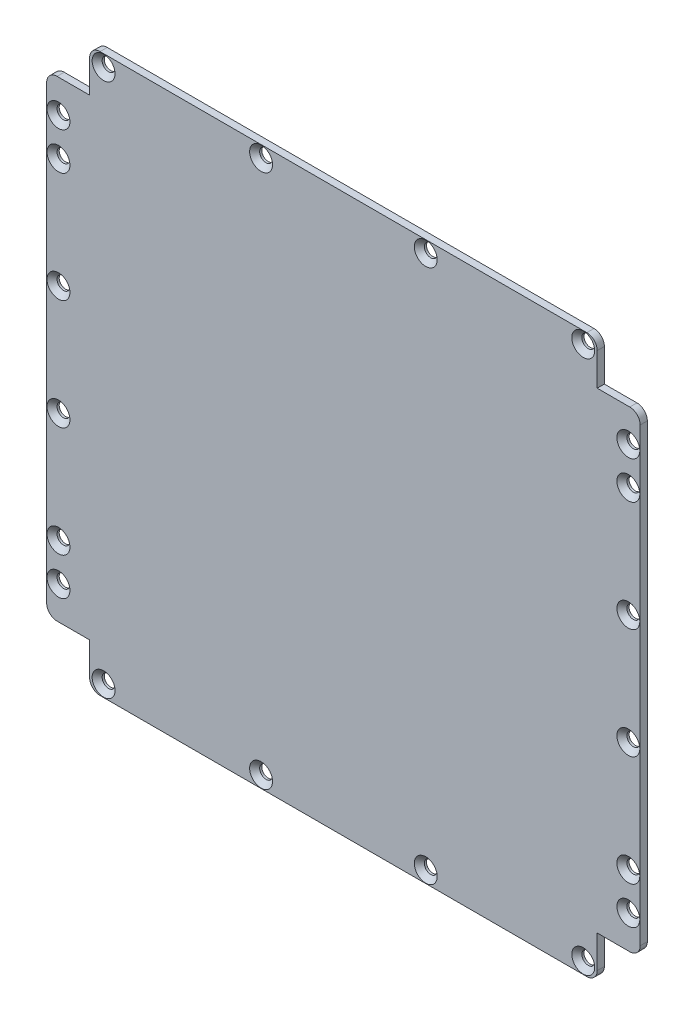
from build123d import *

# Parameters (mm, degrees)
EXTRUDE_1_DEPTH                   = 1
HOLE_WIZARD_1_8_1_8_1_AT_2_COUNT  = 2
HOLE_WIZARD_1_8_1_8_1_AT_2_PITCH  = 22
HOLE_WIZARD_1_8_1_8_1_AT_3_COUNT  = 2
HOLE_WIZARD_1_8_1_8_1_AT_3_PITCH  = 45
HOLE_WIZARD_1_8_1_8_1_AT_4_COUNT  = 2
HOLE_WIZARD_1_8_1_8_1_AT_4_PITCH  = 67
HOLE_WIZARD_1_8_1_8_1_AT_5_COUNT  = 2
HOLE_WIZARD_1_8_1_8_1_AT_5_PITCH  = 73.844380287
HOLE_WIZARD_1_8_1_8_1_AT_6_COUNT  = 2
HOLE_WIZARD_1_8_1_8_1_AT_6_PITCH  = 74.662775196
HOLE_WIZARD_1_8_1_8_1_AT_7_COUNT  = 2
HOLE_WIZARD_1_8_1_8_1_AT_7_PITCH  = 79.050932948
HOLE_WIZARD_1_8_1_8_1_AT_8_COUNT  = 2
HOLE_WIZARD_1_8_1_8_1_AT_8_PITCH  = 86.01098767
HOLE_WIZARD_1_8_1_8_1_AT_9_COUNT  = 2
HOLE_WIZARD_1_8_1_8_1_AT_9_PITCH  = 94.979208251
HOLE_WIZARD_1_8_1_8_1_AT_10_COUNT = 2
HOLE_WIZARD_1_8_1_8_1_AT_10_PITCH = 98.40128302
HOLE_WIZARD_1_8_1_8_1_AT_11_COUNT = 2
HOLE_WIZARD_1_8_1_8_1_AT_11_PITCH = 100.270434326
HOLE_WIZARD_1_8_1_8_1_AT_12_COUNT = 2
HOLE_WIZARD_1_8_1_8_1_AT_12_PITCH = 87.121524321
HOLE_WIZARD_1_8_1_8_1_AT_13_COUNT = 2
HOLE_WIZARD_1_8_1_8_1_AT_13_PITCH = 77.776346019
HOLE_WIZARD_1_8_1_8_1_AT_14_COUNT = 2
HOLE_WIZARD_1_8_1_8_1_AT_14_PITCH = 74.6
HOLE_WIZARD_1_8_1_8_1_AT_15_COUNT = 2
HOLE_WIZARD_1_8_1_8_1_AT_15_PITCH = 65.951592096
HOLE_WIZARD_1_8_1_8_1_AT_16_COUNT = 2
HOLE_WIZARD_1_8_1_8_1_AT_16_PITCH = 60.727670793
HOLE_WIZARD_1_8_1_8_1_AT_17_COUNT = 2
HOLE_WIZARD_1_8_1_8_1_AT_17_PITCH = 45.438860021
HOLE_WIZARD_1_8_1_8_1_AT_18_COUNT = 2
HOLE_WIZARD_1_8_1_8_1_AT_18_PITCH = 30.26301373
HOLE_WIZARD_1_8_1_8_1_AT_19_COUNT = 2
HOLE_WIZARD_1_8_1_8_1_AT_19_PITCH = 15.534799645
HOLE_WIZARD_1_8_1_8_1_AT_20_COUNT = 2
HOLE_WIZARD_1_8_1_8_1_AT_20_PITCH = 10.944976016


with BuildPart() as part:
    # Sketch 2 → Extrude 1 (new body)
    with BuildSketch(Plane.XY):
        with BuildLine():
            Line((408.273154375, 157.374078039), (476.273154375, 157.374078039))
            ThreePointArc((476.273154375, 157.374078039), (477.298459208, 156.949382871), (477.723154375, 155.924078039))
            Line((477.723154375, 155.924078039), (477.723154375, 151.374078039))
            Line((477.723154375, 151.374078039), (482.273154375, 151.374078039))
            ThreePointArc((482.273154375, 151.374078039), (483.298459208, 150.949382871), (483.723154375, 149.924078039))
            Line((483.723154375, 149.924078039), (483.723154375, 86.924078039))
            ThreePointArc((483.723154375, 86.924078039), (483.298459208, 85.898773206), (482.273154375, 85.474078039))
            Line((482.273154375, 85.474078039), (477.723154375, 85.474078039))
            Line((477.723154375, 85.474078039), (477.723154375, 80.924078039))
            ThreePointArc((477.723154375, 80.924078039), (477.298459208, 79.898773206), (476.273154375, 79.474078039))
            Line((476.273154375, 79.474078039), (408.273154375, 79.474078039))
            ThreePointArc((408.273154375, 79.474078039), (407.247849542, 79.898773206), (406.823154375, 80.924078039))
            Line((406.823154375, 80.924078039), (406.823154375, 85.474078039))
            Line((406.823154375, 85.474078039), (402.273154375, 85.474078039))
            ThreePointArc((402.273154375, 85.474078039), (401.247849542, 85.898773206), (400.823154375, 86.924078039))
            Line((400.823154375, 86.924078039), (400.823154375, 149.924078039))
            ThreePointArc((400.823154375, 149.924078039), (401.247849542, 150.949382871), (402.273154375, 151.374078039))
            Line((402.273154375, 151.374078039), (406.823154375, 151.374078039))
            Line((406.823154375, 151.374078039), (406.823154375, 155.924078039))
            ThreePointArc((406.823154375, 155.924078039), (407.247849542, 156.949382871), (408.273154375, 157.374078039))
        make_face()
    extrude(amount=EXTRUDE_1_DEPTH)

    # Sketch 4 → Hole Wizard 1.8 _1.8_ _1 (revolve, cut)
    with BuildSketch(Plane(origin=(408.773154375, 155.724078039, 1), x_dir=(0, -1, 0), z_dir=(1, 0, 0))):
        Polygon((0, 0), (0, 1), (0.9, 1), (0.9, 0.7), (1.6, 0), align=None)
    hole_wizard_1_8_1_8_1 = revolve(axis=Axis((408.773154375, 155.724078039, 7.35), (0, 0, -1)), mode=Mode.SUBTRACT)

    # Hole Wizard 1.8 _1.8_ _1 at 2: Hole Wizard 1.8 _1.8_ _1 ×2
    with Locations(*[(i * HOLE_WIZARD_1_8_1_8_1_AT_2_PITCH, 0, 0) for i in range(1, HOLE_WIZARD_1_8_1_8_1_AT_2_COUNT)]):
        add(hole_wizard_1_8_1_8_1, mode=Mode.SUBTRACT)

    # Hole Wizard 1.8 _1.8_ _1 at 3: Hole Wizard 1.8 _1.8_ _1 ×2
    with Locations(*[(i * HOLE_WIZARD_1_8_1_8_1_AT_3_PITCH, 0, 0) for i in range(1, HOLE_WIZARD_1_8_1_8_1_AT_3_COUNT)]):
        add(hole_wizard_1_8_1_8_1, mode=Mode.SUBTRACT)

    # Hole Wizard 1.8 _1.8_ _1 at 4: Hole Wizard 1.8 _1.8_ _1 ×2
    with Locations(*[(i * HOLE_WIZARD_1_8_1_8_1_AT_4_PITCH, 0, 0) for i in range(1, HOLE_WIZARD_1_8_1_8_1_AT_4_COUNT)]):
        add(hole_wizard_1_8_1_8_1, mode=Mode.SUBTRACT)

    # Hole Wizard 1.8 _1.8_ _1 at 5: Hole Wizard 1.8 _1.8_ _1 ×2
    with Locations(*[Vector(0.9926280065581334, -0.12120082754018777, 0) * (i * HOLE_WIZARD_1_8_1_8_1_AT_5_PITCH) for i in range(1, HOLE_WIZARD_1_8_1_8_1_AT_5_COUNT)]):
        add(hole_wizard_1_8_1_8_1, mode=Mode.SUBTRACT)

    # Hole Wizard 1.8 _1.8_ _1 at 6: Hole Wizard 1.8 _1.8_ _1 ×2
    with Locations(*[Vector(0.9817475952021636, -0.1901884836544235, 0) * (i * HOLE_WIZARD_1_8_1_8_1_AT_6_PITCH) for i in range(1, HOLE_WIZARD_1_8_1_8_1_AT_6_COUNT)]):
        add(hole_wizard_1_8_1_8_1, mode=Mode.SUBTRACT)

    # Hole Wizard 1.8 _1.8_ _1 at 7: Hole Wizard 1.8 _1.8_ _1 ×2
    with Locations(*[Vector(0.9272502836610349, -0.37444213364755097, 0) * (i * HOLE_WIZARD_1_8_1_8_1_AT_7_PITCH) for i in range(1, HOLE_WIZARD_1_8_1_8_1_AT_7_COUNT)]):
        add(hole_wizard_1_8_1_8_1, mode=Mode.SUBTRACT)

    # Hole Wizard 1.8 _1.8_ _1 at 8: Hole Wizard 1.8 _1.8_ _1 ×2
    with Locations(*[Vector(0.8522166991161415, -0.523188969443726, 0) * (i * HOLE_WIZARD_1_8_1_8_1_AT_8_PITCH) for i in range(1, HOLE_WIZARD_1_8_1_8_1_AT_8_COUNT)]):
        add(hole_wizard_1_8_1_8_1, mode=Mode.SUBTRACT)

    # Hole Wizard 1.8 _1.8_ _1 at 9: Hole Wizard 1.8 _1.8_ _1 ×2
    with Locations(*[Vector(0.7717478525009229, -0.6359286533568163, 0) * (i * HOLE_WIZARD_1_8_1_8_1_AT_9_PITCH) for i in range(1, HOLE_WIZARD_1_8_1_8_1_AT_9_COUNT)]):
        add(hole_wizard_1_8_1_8_1, mode=Mode.SUBTRACT)

    # Hole Wizard 1.8 _1.8_ _1 at 10: Hole Wizard 1.8 _1.8_ _1 ×2
    with Locations(*[Vector(0.7449089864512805, -0.6671660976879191, 0) * (i * HOLE_WIZARD_1_8_1_8_1_AT_10_PITCH) for i in range(1, HOLE_WIZARD_1_8_1_8_1_AT_10_COUNT)]):
        add(hole_wizard_1_8_1_8_1, mode=Mode.SUBTRACT)

    # Hole Wizard 1.8 _1.8_ _1 at 11: Hole Wizard 1.8 _1.8_ _1 ×2
    with Locations(*[Vector(0.6681929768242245, -0.7439880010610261, 0) * (i * HOLE_WIZARD_1_8_1_8_1_AT_11_PITCH) for i in range(1, HOLE_WIZARD_1_8_1_8_1_AT_11_COUNT)]):
        add(hole_wizard_1_8_1_8_1, mode=Mode.SUBTRACT)

    # Hole Wizard 1.8 _1.8_ _1 at 12: Hole Wizard 1.8 _1.8_ _1 ×2
    with Locations(*[Vector(0.5165198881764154, -0.8562751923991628, 0) * (i * HOLE_WIZARD_1_8_1_8_1_AT_12_PITCH) for i in range(1, HOLE_WIZARD_1_8_1_8_1_AT_12_COUNT)]):
        add(hole_wizard_1_8_1_8_1, mode=Mode.SUBTRACT)

    # Hole Wizard 1.8 _1.8_ _1 at 13: Hole Wizard 1.8 _1.8_ _1 ×2
    with Locations(*[Vector(0.28286234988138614, -0.9591605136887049, 0) * (i * HOLE_WIZARD_1_8_1_8_1_AT_13_PITCH) for i in range(1, HOLE_WIZARD_1_8_1_8_1_AT_13_COUNT)]):
        add(hole_wizard_1_8_1_8_1, mode=Mode.SUBTRACT)

    # Hole Wizard 1.8 _1.8_ _1 at 14: Hole Wizard 1.8 _1.8_ _1 ×2
    with Locations(*[(0, -i * HOLE_WIZARD_1_8_1_8_1_AT_14_PITCH, 0) for i in range(1, HOLE_WIZARD_1_8_1_8_1_AT_14_COUNT)]):
        add(hole_wizard_1_8_1_8_1, mode=Mode.SUBTRACT)

    # Hole Wizard 1.8 _1.8_ _1 at 15: Hole Wizard 1.8 _1.8_ _1 ×2
    with Locations(*[Vector(-0.09552460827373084, -0.9954270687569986, 0) * (i * HOLE_WIZARD_1_8_1_8_1_AT_15_PITCH) for i in range(1, HOLE_WIZARD_1_8_1_8_1_AT_15_COUNT)]):
        add(hole_wizard_1_8_1_8_1, mode=Mode.SUBTRACT)

    # Hole Wizard 1.8 _1.8_ _1 at 16: Hole Wizard 1.8 _1.8_ _1 ×2
    with Locations(*[Vector(-0.10374183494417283, -0.9946042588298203, 0) * (i * HOLE_WIZARD_1_8_1_8_1_AT_16_PITCH) for i in range(1, HOLE_WIZARD_1_8_1_8_1_AT_16_COUNT)]):
        add(hole_wizard_1_8_1_8_1, mode=Mode.SUBTRACT)

    # Hole Wizard 1.8 _1.8_ _1 at 17: Hole Wizard 1.8 _1.8_ _1 ×2
    with Locations(*[Vector(-0.13864784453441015, -0.9903417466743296, 0) * (i * HOLE_WIZARD_1_8_1_8_1_AT_17_PITCH) for i in range(1, HOLE_WIZARD_1_8_1_8_1_AT_17_COUNT)]):
        add(hole_wizard_1_8_1_8_1, mode=Mode.SUBTRACT)

    # Hole Wizard 1.8 _1.8_ _1 at 18: Hole Wizard 1.8 _1.8_ _1 ×2
    with Locations(*[Vector(-0.20817490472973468, -0.9780916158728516, 0) * (i * HOLE_WIZARD_1_8_1_8_1_AT_18_PITCH) for i in range(1, HOLE_WIZARD_1_8_1_8_1_AT_18_COUNT)]):
        add(hole_wizard_1_8_1_8_1, mode=Mode.SUBTRACT)

    # Hole Wizard 1.8 _1.8_ _1 at 19: Hole Wizard 1.8 _1.8_ _1 ×2
    with Locations(*[Vector(-0.405541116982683, -0.9140768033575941, 0) * (i * HOLE_WIZARD_1_8_1_8_1_AT_19_PITCH) for i in range(1, HOLE_WIZARD_1_8_1_8_1_AT_19_COUNT)]):
        add(hole_wizard_1_8_1_8_1, mode=Mode.SUBTRACT)

    # Hole Wizard 1.8 _1.8_ _1 at 20: Hole Wizard 1.8 _1.8_ _1 ×2
    with Locations(*[Vector(-0.5756065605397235, -0.8177267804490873, 0) * (i * HOLE_WIZARD_1_8_1_8_1_AT_20_PITCH) for i in range(1, HOLE_WIZARD_1_8_1_8_1_AT_20_COUNT)]):
        add(hole_wizard_1_8_1_8_1, mode=Mode.SUBTRACT)


solid = part.part
